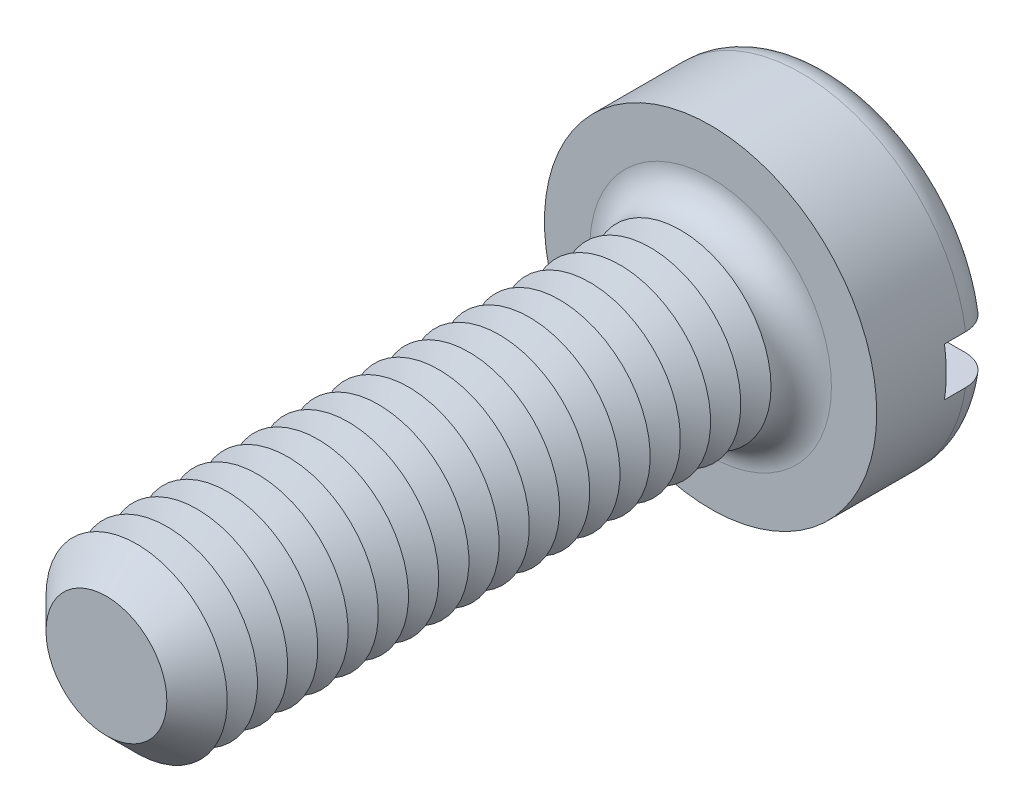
from build123d import *

# Parameters (mm, degrees)
SKETCH3_R           = 2.75
BOSS_EXTRUDE2_DEPTH = 2
SKETCH4_R           = 1.5
BOSS_EXTRUDE3_DEPTH = 10
FILLET1_R           = 0.5
CHAMFER1_SIZE       = 0.5
LPATTERN1_COUNT     = 18
LPATTERN1_PITCH     = 0.5
SKETCH8_W           = 5.5
SKETCH8_H           = 0.8
CUT_EXTRUDE1_DEPTH  = 0.85


with BuildPart() as part:
    # Sketch3 → Boss-Extrude2 (new body)
    with BuildSketch(Plane.XY):
        Circle(SKETCH3_R)
    extrude(amount=-BOSS_EXTRUDE2_DEPTH)

    # Sketch4 → Boss-Extrude3 (add)
    with BuildSketch(Plane.XY):
        Circle(SKETCH4_R)
    extrude(amount=BOSS_EXTRUDE3_DEPTH)

    # Fillet1
    fillet1_edges = [part.edges().sort_by_distance(p)[0] for p in [
        (-2.75, 0, -2),
        (-1.5, 0, 0),
    ]]
    fillet(fillet1_edges, radius=FILLET1_R)

    # Chamfer1
    chamfer1_edges = [part.edges().sort_by_distance(p)[0] for p in [
        (-1.5, 0, 10),
    ]]
    chamfer(chamfer1_edges, length=CHAMFER1_SIZE)

    # Sketch6 → Cut-Revolve1 (revolve, cut)
    with BuildSketch(Plane(origin=(0, 0, 0), x_dir=(0, 0, -1), z_dir=(1, 0, 0)), mode=Mode.PRIVATE) as cut_revolve1_sk:
        Polygon((-0.5, 1.5), (-0.75, 1.066987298), (-1, 1.5), align=None)
    cut_revolve1 = revolve(cut_revolve1_sk.sketch.rotate(Axis((0, 0, -1.694361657), (0, 0, 1)), 90), axis=Axis((0, 0, -1.694361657), (0, 0, 1)), mode=Mode.SUBTRACT)

    # LPattern1: Cut-Revolve1 ×18
    with Locations(*[(0, 0, i * LPATTERN1_PITCH) for i in range(1, LPATTERN1_COUNT)]):
        add(cut_revolve1, mode=Mode.SUBTRACT)

    # Sketch8 → Cut-Extrude1 (cut)
    with BuildSketch(Plane(origin=(0, 0, -2), x_dir=(-1, 0, 0), z_dir=(0, 0, -1))):
        Rectangle(SKETCH8_W, SKETCH8_H)
    extrude(amount=-CUT_EXTRUDE1_DEPTH, mode=Mode.SUBTRACT)


solid = part.part
